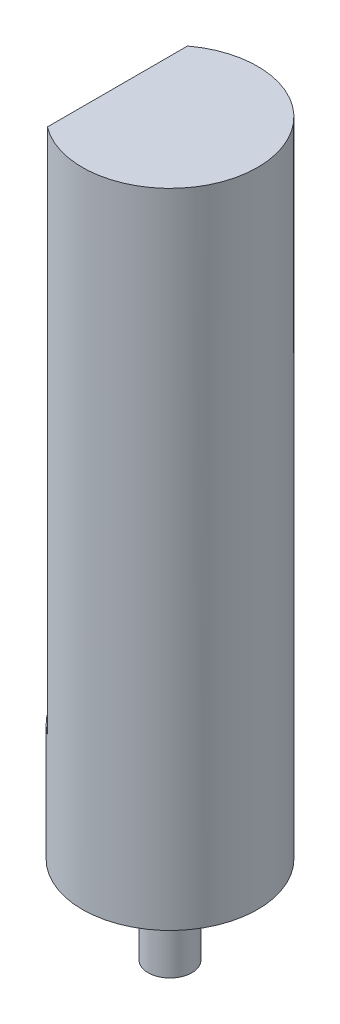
from build123d import *

# Parameters (mm, degrees)
SKETCH_1_R          = 1.5
EXTRUDE_1_DEPTH     = 11
CUT_EXTRUDE_START   = -9
CUT_EXTRUDE_1_DEPTH = 9
SKETCH_3_R          = 0.375
EXTRUDE_2_DEPTH     = 1.5


with BuildPart() as part:
    # Sketch 1 → Extrude 1 (new body)
    with BuildSketch(Plane(origin=(0, 0, 0), x_dir=(1, 0, 0), z_dir=(0, 1, 0))):
        with Locations(Location((0, 0, 0), (0, 0, 270))):
            Circle(SKETCH_1_R)
    extrude(amount=EXTRUDE_1_DEPTH)

    # Sketch 2 → Cut-Extrude 1 (cut)
    with BuildSketch(Plane(origin=(0, 11, 0), x_dir=(1, 0, 0), z_dir=(0, 1, 0)).offset(CUT_EXTRUDE_START)):
        with BuildLine():
            Line((-0.9, -1.2), (-0.9, 1.2))
            ThreePointArc((-0.9, 1.2), (-1.5, 0), (-0.9, -1.2))
        make_face()
    extrude(amount=CUT_EXTRUDE_1_DEPTH, mode=Mode.SUBTRACT)

    # Sketch 3 → Extrude 2 (add)
    with BuildSketch(Plane.XZ):
        with Locations(Location((0, 0, 0), (0, 0, 90))):
            Circle(SKETCH_3_R)
    extrude(amount=EXTRUDE_2_DEPTH)


solid = part.part
